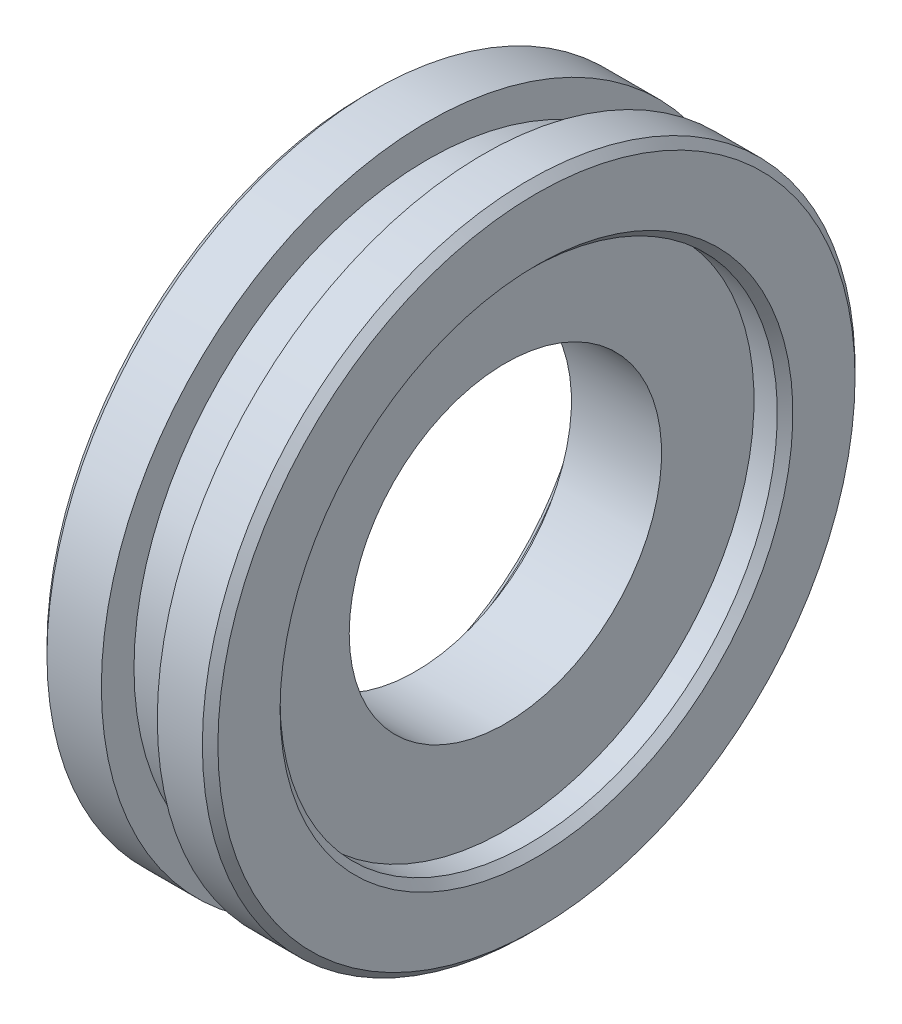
ISO-10303-21;
HEADER;
FILE_DESCRIPTION(('STEP AP214'),'2;1');
FILE_NAME('part.step','',(''),(''),'','','');
FILE_SCHEMA(('AUTOMOTIVE_DESIGN { 1 0 10303 214 1 1 1 1 }'));
ENDSEC;
DATA;
#1=APPLICATION_CONTEXT('core data for automotive mechanical design processes');
#2=APPLICATION_PROTOCOL_DEFINITION('international standard','automotive_design',2000,#1);
#3=PRODUCT_CONTEXT('',#1,'mechanical');
#4=PRODUCT('Part','Part','',(#3));
#5=PRODUCT_RELATED_PRODUCT_CATEGORY('part','',(#4));
#6=PRODUCT_DEFINITION_FORMATION('','',#4);
#7=PRODUCT_DEFINITION_CONTEXT('part definition',#1,'design');
#8=PRODUCT_DEFINITION('design','',#6,#7);
#9=PRODUCT_DEFINITION_SHAPE('','',#8);
#10=(LENGTH_UNIT() NAMED_UNIT(*) SI_UNIT(.MILLI.,.METRE.));
#11=(NAMED_UNIT(*) PLANE_ANGLE_UNIT() SI_UNIT($,.RADIAN.));
#12=(NAMED_UNIT(*) SI_UNIT($,.STERADIAN.) SOLID_ANGLE_UNIT());
#13=UNCERTAINTY_MEASURE_WITH_UNIT(LENGTH_MEASURE(1.E-05),#10,'distance_accuracy_value','');
#14=(GEOMETRIC_REPRESENTATION_CONTEXT(3) GLOBAL_UNCERTAINTY_ASSIGNED_CONTEXT((#13)) GLOBAL_UNIT_ASSIGNED_CONTEXT((#10,
#11,#12)) REPRESENTATION_CONTEXT('',''));
#15=CARTESIAN_POINT('',(0.,0.,0.));
#16=DIRECTION('',(0.,0.,1.));
#17=DIRECTION('',(1.,0.,0.));
#18=AXIS2_PLACEMENT_3D('',#15,#16,#17);
#19=CARTESIAN_POINT('',(0.,13.75,0.));
#20=DIRECTION('',(1.,0.,0.));
#21=DIRECTION('',(0.,0.,-1.));
#22=AXIS2_PLACEMENT_3D('',#19,#20,#21);
#23=PLANE('',#22);
#24=CARTESIAN_POINT('',(0.,0.,0.));
#25=DIRECTION('',(1.,0.,0.));
#26=DIRECTION('',(0.,0.,-1.));
#27=AXIS2_PLACEMENT_3D('',#24,#25,#26);
#28=CIRCLE('',#27,20.5);
#29=CARTESIAN_POINT('',(0.,0.,-20.5));
#30=VERTEX_POINT('',#29);
#31=EDGE_CURVE('E39',#30,#30,#28,.F.);
#32=ORIENTED_EDGE('',*,*,#31,.T.);
#33=EDGE_LOOP('',(#32));
#34=FACE_BOUND('',#33,.T.);
#35=CARTESIAN_POINT('',(0.,0.,0.));
#36=DIRECTION('',(1.,0.,0.));
#37=DIRECTION('',(0.,0.,-1.));
#38=AXIS2_PLACEMENT_3D('',#35,#36,#37);
#39=CIRCLE('',#38,14.25);
#40=CARTESIAN_POINT('',(0.,0.,-14.25));
#41=VERTEX_POINT('',#40);
#42=EDGE_CURVE('E43',#41,#41,#39,.T.);
#43=ORIENTED_EDGE('',*,*,#42,.T.);
#44=EDGE_LOOP('',(#43));
#45=FACE_BOUND('',#44,.T.);
#46=ADVANCED_FACE('F29',(#34,#45),#23,.F.);
#47=CARTESIAN_POINT('',(0.,0.,0.));
#48=DIRECTION('',(-1.,0.,0.));
#49=DIRECTION('',(0.,0.,1.));
#50=AXIS2_PLACEMENT_3D('',#47,#48,#49);
#51=CYLINDRICAL_SURFACE('',#50,21.);
#52=CARTESIAN_POINT('',(0.499999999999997,0.,0.));
#53=DIRECTION('',(1.,0.,0.));
#54=DIRECTION('',(0.,0.,-1.));
#55=AXIS2_PLACEMENT_3D('',#52,#53,#54);
#56=CIRCLE('',#55,21.);
#57=CARTESIAN_POINT('',(0.499999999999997,0.,-21.));
#58=VERTEX_POINT('',#57);
#59=EDGE_CURVE('E35',#58,#58,#56,.T.);
#60=ORIENTED_EDGE('',*,*,#59,.T.);
#61=EDGE_LOOP('',(#60));
#62=FACE_BOUND('',#61,.T.);
#63=CARTESIAN_POINT('',(4.,0.,0.));
#64=DIRECTION('',(-1.,0.,0.));
#65=DIRECTION('',(0.,0.,1.));
#66=AXIS2_PLACEMENT_3D('',#63,#64,#65);
#67=CIRCLE('',#66,21.);
#68=CARTESIAN_POINT('',(4.,0.,21.));
#69=VERTEX_POINT('',#68);
#70=EDGE_CURVE('E60',#69,#69,#67,.T.);
#71=ORIENTED_EDGE('',*,*,#70,.T.);
#72=EDGE_LOOP('',(#71));
#73=FACE_BOUND('',#72,.T.);
#74=ADVANCED_FACE('F102',(#62,#73),#51,.T.);
#75=CARTESIAN_POINT('',(4.,21.,0.));
#76=DIRECTION('',(-1.,0.,0.));
#77=DIRECTION('',(0.,0.,1.));
#78=AXIS2_PLACEMENT_3D('',#75,#76,#77);
#79=PLANE('',#78);
#80=ORIENTED_EDGE('',*,*,#70,.F.);
#81=EDGE_LOOP('',(#80));
#82=FACE_BOUND('',#81,.T.);
#83=CARTESIAN_POINT('',(4.,0.,0.));
#84=DIRECTION('',(-1.,0.,0.));
#85=DIRECTION('',(0.,0.,1.));
#86=AXIS2_PLACEMENT_3D('',#83,#84,#85);
#87=CIRCLE('',#86,18.9);
#88=CARTESIAN_POINT('',(4.,0.,18.9));
#89=VERTEX_POINT('',#88);
#90=EDGE_CURVE('E63',#89,#89,#87,.T.);
#91=ORIENTED_EDGE('',*,*,#90,.T.);
#92=EDGE_LOOP('',(#91));
#93=FACE_BOUND('',#92,.T.);
#94=ADVANCED_FACE('F107',(#82,#93),#79,.F.);
#95=CARTESIAN_POINT('',(0.,0.,0.));
#96=DIRECTION('',(-1.,0.,0.));
#97=DIRECTION('',(0.,0.,1.));
#98=AXIS2_PLACEMENT_3D('',#95,#96,#97);
#99=CYLINDRICAL_SURFACE('',#98,18.9);
#100=ORIENTED_EDGE('',*,*,#90,.F.);
#101=EDGE_LOOP('',(#100));
#102=FACE_BOUND('',#101,.T.);
#103=CARTESIAN_POINT('',(7.6,0.,0.));
#104=DIRECTION('',(-1.,0.,0.));
#105=DIRECTION('',(0.,0.,1.));
#106=AXIS2_PLACEMENT_3D('',#103,#104,#105);
#107=CIRCLE('',#106,18.9);
#108=CARTESIAN_POINT('',(7.6,0.,18.9));
#109=VERTEX_POINT('',#108);
#110=EDGE_CURVE('E66',#109,#109,#107,.T.);
#111=ORIENTED_EDGE('',*,*,#110,.T.);
#112=EDGE_LOOP('',(#111));
#113=FACE_BOUND('',#112,.T.);
#114=ADVANCED_FACE('F140',(#102,#113),#99,.T.);
#115=CARTESIAN_POINT('',(7.6,18.9,0.));
#116=DIRECTION('',(1.,0.,0.));
#117=DIRECTION('',(0.,0.,-1.));
#118=AXIS2_PLACEMENT_3D('',#115,#116,#117);
#119=PLANE('',#118);
#120=ORIENTED_EDGE('',*,*,#110,.F.);
#121=EDGE_LOOP('',(#120));
#122=FACE_BOUND('',#121,.T.);
#123=CARTESIAN_POINT('',(7.6,0.,0.));
#124=DIRECTION('',(-1.,0.,0.));
#125=DIRECTION('',(0.,0.,1.));
#126=AXIS2_PLACEMENT_3D('',#123,#124,#125);
#127=CIRCLE('',#126,21.);
#128=CARTESIAN_POINT('',(7.6,0.,21.));
#129=VERTEX_POINT('',#128);
#130=EDGE_CURVE('E69',#129,#129,#127,.T.);
#131=ORIENTED_EDGE('',*,*,#130,.T.);
#132=EDGE_LOOP('',(#131));
#133=FACE_BOUND('',#132,.T.);
#134=ADVANCED_FACE('F135',(#122,#133),#119,.F.);
#135=CARTESIAN_POINT('',(0.,0.,0.));
#136=DIRECTION('',(-1.,0.,0.));
#137=DIRECTION('',(0.,0.,1.));
#138=AXIS2_PLACEMENT_3D('',#135,#136,#137);
#139=CYLINDRICAL_SURFACE('',#138,21.);
#140=CARTESIAN_POINT('',(10.5,0.,0.));
#141=DIRECTION('',(-1.,0.,0.));
#142=DIRECTION('',(0.,0.,1.));
#143=AXIS2_PLACEMENT_3D('',#140,#141,#142);
#144=CIRCLE('',#143,21.);
#145=CARTESIAN_POINT('',(10.5,0.,21.));
#146=VERTEX_POINT('',#145);
#147=EDGE_CURVE('E48',#146,#146,#144,.T.);
#148=ORIENTED_EDGE('',*,*,#147,.T.);
#149=EDGE_LOOP('',(#148));
#150=FACE_BOUND('',#149,.T.);
#151=ORIENTED_EDGE('',*,*,#130,.F.);
#152=EDGE_LOOP('',(#151));
#153=FACE_BOUND('',#152,.T.);
#154=ADVANCED_FACE('F131',(#150,#153),#139,.T.);
#155=CARTESIAN_POINT('',(11.,21.,0.));
#156=DIRECTION('',(-1.,0.,0.));
#157=DIRECTION('',(0.,0.,1.));
#158=AXIS2_PLACEMENT_3D('',#155,#156,#157);
#159=PLANE('',#158);
#160=CARTESIAN_POINT('',(11.,0.,0.));
#161=DIRECTION('',(-1.,0.,0.));
#162=DIRECTION('',(0.,0.,1.));
#163=AXIS2_PLACEMENT_3D('',#160,#161,#162);
#164=CIRCLE('',#163,16.5);
#165=CARTESIAN_POINT('',(11.,0.,16.5));
#166=VERTEX_POINT('',#165);
#167=EDGE_CURVE('E54',#166,#166,#164,.T.);
#168=ORIENTED_EDGE('',*,*,#167,.T.);
#169=EDGE_LOOP('',(#168));
#170=FACE_BOUND('',#169,.T.);
#171=CARTESIAN_POINT('',(11.,0.,0.));
#172=DIRECTION('',(-1.,0.,0.));
#173=DIRECTION('',(0.,0.,1.));
#174=AXIS2_PLACEMENT_3D('',#171,#172,#173);
#175=CIRCLE('',#174,20.5);
#176=CARTESIAN_POINT('',(11.,0.,20.5));
#177=VERTEX_POINT('',#176);
#178=EDGE_CURVE('E57',#177,#177,#175,.F.);
#179=ORIENTED_EDGE('',*,*,#178,.T.);
#180=EDGE_LOOP('',(#179));
#181=FACE_BOUND('',#180,.T.);
#182=ADVANCED_FACE('F134',(#170,#181),#159,.F.);
#183=CARTESIAN_POINT('',(0.,0.,0.));
#184=DIRECTION('',(-1.,0.,0.));
#185=DIRECTION('',(0.,0.,1.));
#186=AXIS2_PLACEMENT_3D('',#183,#184,#185);
#187=CYLINDRICAL_SURFACE('',#186,16.);
#188=CARTESIAN_POINT('',(10.5,0.,0.));
#189=DIRECTION('',(-1.,0.,0.));
#190=DIRECTION('',(0.,0.,1.));
#191=AXIS2_PLACEMENT_3D('',#188,#189,#190);
#192=CIRCLE('',#191,16.);
#193=CARTESIAN_POINT('',(10.5,0.,16.));
#194=VERTEX_POINT('',#193);
#195=EDGE_CURVE('E51',#194,#194,#192,.F.);
#196=ORIENTED_EDGE('',*,*,#195,.T.);
#197=EDGE_LOOP('',(#196));
#198=FACE_BOUND('',#197,.T.);
#199=CARTESIAN_POINT('',(9.,0.,0.));
#200=DIRECTION('',(-1.,0.,0.));
#201=DIRECTION('',(0.,0.,1.));
#202=AXIS2_PLACEMENT_3D('',#199,#200,#201);
#203=CIRCLE('',#202,16.);
#204=CARTESIAN_POINT('',(9.,0.,16.));
#205=VERTEX_POINT('',#204);
#206=EDGE_CURVE('E72',#205,#205,#203,.T.);
#207=ORIENTED_EDGE('',*,*,#206,.T.);
#208=EDGE_LOOP('',(#207));
#209=FACE_BOUND('',#208,.T.);
#210=ADVANCED_FACE('F181',(#198,#209),#187,.F.);
#211=CARTESIAN_POINT('',(9.,16.,0.));
#212=DIRECTION('',(-1.,0.,0.));
#213=DIRECTION('',(0.,0.,1.));
#214=AXIS2_PLACEMENT_3D('',#211,#212,#213);
#215=PLANE('',#214);
#216=ORIENTED_EDGE('',*,*,#206,.F.);
#217=EDGE_LOOP('',(#216));
#218=FACE_BOUND('',#217,.T.);
#219=CARTESIAN_POINT('',(9.,0.,0.));
#220=DIRECTION('',(-1.,0.,0.));
#221=DIRECTION('',(0.,0.,1.));
#222=AXIS2_PLACEMENT_3D('',#219,#220,#221);
#223=CIRCLE('',#222,10.05);
#224=CARTESIAN_POINT('',(9.,0.,10.05));
#225=VERTEX_POINT('',#224);
#226=EDGE_CURVE('E75',#225,#225,#223,.T.);
#227=ORIENTED_EDGE('',*,*,#226,.T.);
#228=EDGE_LOOP('',(#227));
#229=FACE_BOUND('',#228,.T.);
#230=ADVANCED_FACE('F176',(#218,#229),#215,.F.);
#231=CARTESIAN_POINT('',(0.,0.,0.));
#232=DIRECTION('',(-1.,0.,0.));
#233=DIRECTION('',(0.,0.,1.));
#234=AXIS2_PLACEMENT_3D('',#231,#232,#233);
#235=CYLINDRICAL_SURFACE('',#234,10.05);
#236=ORIENTED_EDGE('',*,*,#226,.F.);
#237=EDGE_LOOP('',(#236));
#238=FACE_BOUND('',#237,.T.);
#239=CARTESIAN_POINT('',(3.2,0.,0.));
#240=DIRECTION('',(-1.,0.,0.));
#241=DIRECTION('',(0.,0.,1.));
#242=AXIS2_PLACEMENT_3D('',#239,#240,#241);
#243=CIRCLE('',#242,10.05);
#244=CARTESIAN_POINT('',(3.2,0.,10.05));
#245=VERTEX_POINT('',#244);
#246=EDGE_CURVE('E78',#245,#245,#243,.T.);
#247=ORIENTED_EDGE('',*,*,#246,.T.);
#248=EDGE_LOOP('',(#247));
#249=FACE_BOUND('',#248,.T.);
#250=ADVANCED_FACE('F98',(#238,#249),#235,.F.);
#251=CARTESIAN_POINT('',(3.2,10.05,0.));
#252=DIRECTION('',(1.,0.,0.));
#253=DIRECTION('',(0.,0.,-1.));
#254=AXIS2_PLACEMENT_3D('',#251,#252,#253);
#255=PLANE('',#254);
#256=ORIENTED_EDGE('',*,*,#246,.F.);
#257=EDGE_LOOP('',(#256));
#258=FACE_BOUND('',#257,.T.);
#259=CARTESIAN_POINT('',(3.2,0.,0.));
#260=DIRECTION('',(-1.,0.,0.));
#261=DIRECTION('',(0.,0.,1.));
#262=AXIS2_PLACEMENT_3D('',#259,#260,#261);
#263=CIRCLE('',#262,13.75);
#264=CARTESIAN_POINT('',(3.2,0.,13.75));
#265=VERTEX_POINT('',#264);
#266=EDGE_CURVE('E81',#265,#265,#263,.T.);
#267=ORIENTED_EDGE('',*,*,#266,.T.);
#268=EDGE_LOOP('',(#267));
#269=FACE_BOUND('',#268,.T.);
#270=ADVANCED_FACE('F85',(#258,#269),#255,.F.);
#271=CARTESIAN_POINT('',(0.,0.,0.));
#272=DIRECTION('',(-1.,0.,0.));
#273=DIRECTION('',(0.,0.,1.));
#274=AXIS2_PLACEMENT_3D('',#271,#272,#273);
#275=CYLINDRICAL_SURFACE('',#274,13.75);
#276=CARTESIAN_POINT('',(0.49999999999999,0.,0.));
#277=DIRECTION('',(1.,0.,0.));
#278=DIRECTION('',(0.,0.,-1.));
#279=AXIS2_PLACEMENT_3D('',#276,#277,#278);
#280=CIRCLE('',#279,13.75);
#281=CARTESIAN_POINT('',(0.49999999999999,0.,-13.75));
#282=VERTEX_POINT('',#281);
#283=EDGE_CURVE('E10',#282,#282,#280,.F.);
#284=ORIENTED_EDGE('',*,*,#283,.T.);
#285=EDGE_LOOP('',(#284));
#286=FACE_BOUND('',#285,.T.);
#287=ORIENTED_EDGE('',*,*,#266,.F.);
#288=EDGE_LOOP('',(#287));
#289=FACE_BOUND('',#288,.T.);
#290=ADVANCED_FACE('F87',(#286,#289),#275,.F.);
#291=CARTESIAN_POINT('',(11.,0.,0.));
#292=DIRECTION('',(1.,0.,0.));
#293=DIRECTION('',(0.,0.,-1.));
#294=AXIS2_PLACEMENT_3D('',#291,#292,#293);
#295=CONICAL_SURFACE('',#294,16.5,0.785398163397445);
#296=ORIENTED_EDGE('',*,*,#195,.F.);
#297=EDGE_LOOP('',(#296));
#298=FACE_BOUND('',#297,.T.);
#299=ORIENTED_EDGE('',*,*,#167,.F.);
#300=EDGE_LOOP('',(#299));
#301=FACE_BOUND('',#300,.T.);
#302=ADVANCED_FACE('F89',(#298,#301),#295,.F.);
#303=CARTESIAN_POINT('',(10.5,0.,0.));
#304=DIRECTION('',(-1.,0.,0.));
#305=DIRECTION('',(0.,0.,1.));
#306=AXIS2_PLACEMENT_3D('',#303,#304,#305);
#307=CONICAL_SURFACE('',#306,21.,0.785398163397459);
#308=ORIENTED_EDGE('',*,*,#178,.F.);
#309=EDGE_LOOP('',(#308));
#310=FACE_BOUND('',#309,.T.);
#311=ORIENTED_EDGE('',*,*,#147,.F.);
#312=EDGE_LOOP('',(#311));
#313=FACE_BOUND('',#312,.T.);
#314=ADVANCED_FACE('F95',(#310,#313),#307,.T.);
#315=CARTESIAN_POINT('',(0.,0.,0.));
#316=DIRECTION('',(1.,0.,0.));
#317=DIRECTION('',(0.,0.,-1.));
#318=AXIS2_PLACEMENT_3D('',#315,#316,#317);
#319=CONICAL_SURFACE('',#318,20.5,0.785398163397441);
#320=ORIENTED_EDGE('',*,*,#59,.F.);
#321=EDGE_LOOP('',(#320));
#322=FACE_BOUND('',#321,.T.);
#323=ORIENTED_EDGE('',*,*,#31,.F.);
#324=EDGE_LOOP('',(#323));
#325=FACE_BOUND('',#324,.T.);
#326=ADVANCED_FACE('F115',(#322,#325),#319,.T.);
#327=CARTESIAN_POINT('',(0.49999999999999,0.,0.));
#328=DIRECTION('',(-1.,0.,0.));
#329=DIRECTION('',(0.,0.,1.));
#330=AXIS2_PLACEMENT_3D('',#327,#328,#329);
#331=CONICAL_SURFACE('',#330,13.75,0.785398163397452);
#332=ORIENTED_EDGE('',*,*,#42,.F.);
#333=EDGE_LOOP('',(#332));
#334=FACE_BOUND('',#333,.T.);
#335=ORIENTED_EDGE('',*,*,#283,.F.);
#336=EDGE_LOOP('',(#335));
#337=FACE_BOUND('',#336,.T.);
#338=ADVANCED_FACE('F112',(#334,#337),#331,.F.);
#339=CLOSED_SHELL('',(#46,#74,#94,#114,#134,#154,#182,#210,#230,#250,#270,#290,#302,#314,#326,#338));
#340=MANIFOLD_SOLID_BREP('B2',#339);
#341=ADVANCED_BREP_SHAPE_REPRESENTATION('',(#18,#340),#14);
#342=SHAPE_DEFINITION_REPRESENTATION(#9,#341);
ENDSEC;
END-ISO-10303-21;
